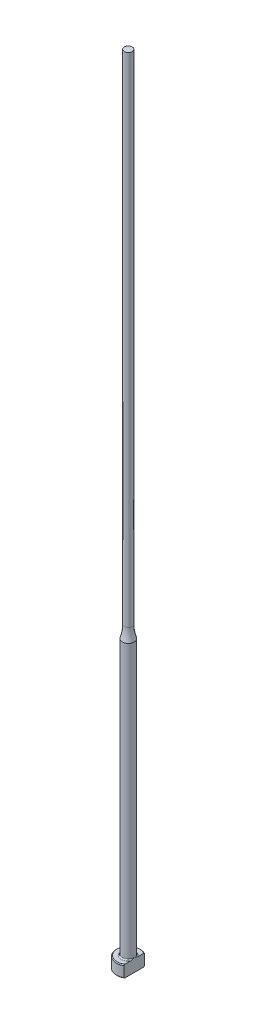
from build123d import *
from build123d.topology import SkipClean

# Parameters (mm, degrees)
CHAMFER1_SIZE = 0.2
FILLET1_R     = 0.3
KEY_DEPTH     = 201.044994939


with BuildPart() as part:
    # Sketch1 → Revolve1 (revolve)
    with BuildSketch(Plane.XY, mode=Mode.PRIVATE) as revolve1_sk:
        with BuildLine():
            Line((0, 0), (-3, 0))
            Line((-3, 0), (-3, 3))
            Line((-3, 3), (-1.5, 3))
            Line((-1.5, 3), (-1.5, 71.877501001))
            ThreePointArc((-1.5, 71.877501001), (-1.125791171, 73.41886117), (-1, 75))
            Line((-1, 75), (-1, 200))
            Line((-1, 200), (0, 200))
            Line((0, 200), (0, 0))
        make_face()
    revolve(revolve1_sk.sketch.rotate(Axis((0, 259.958771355, 0), (0, -1, 0)), 270), axis=Axis((0, 259.958771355, 0), (0, -1, 0)))

    # Chamfer1
    chamfer1_edges = [part.edges().sort_by_distance(p)[0] for p in [
        (0, 0, -3),
        (0, 3, -3),
    ]]
    chamfer(chamfer1_edges, length=CHAMFER1_SIZE)

    # Fillet1
    fillet1_edges = [part.edges().sort_by_distance(p)[0] for p in [
        (0, 3, -1.5),
    ]]
    fillet(fillet1_edges, radius=FILLET1_R)

    # Sketch2 → KEY (cut, through all)
    with SkipClean():  # the faces are left unmerged after this step: merging them gives an invalid solid
        with BuildSketch(Plane(origin=(0, 0, 0), x_dir=(1, 0, 0), z_dir=(0, 1, 0))):
            with BuildLine():
                Line((1.5, 2.598076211), (1.5, -2.598076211))
                ThreePointArc((1.5, -2.598076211), (3, 0), (1.5, 2.598076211))
            make_face()
        extrude(amount=KEY_DEPTH, mode=Mode.SUBTRACT)


solid = part.part
